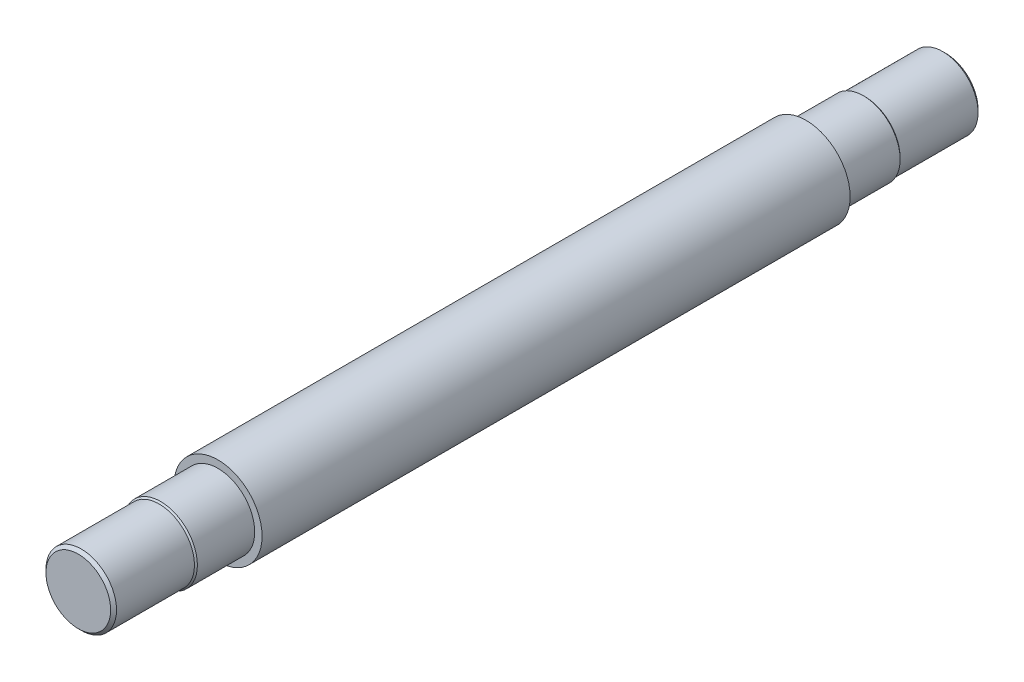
ISO-10303-21;
HEADER;
FILE_DESCRIPTION(('STEP AP214'),'2;1');
FILE_NAME('part.step','',(''),(''),'','','');
FILE_SCHEMA(('AUTOMOTIVE_DESIGN { 1 0 10303 214 1 1 1 1 }'));
ENDSEC;
DATA;
#1=APPLICATION_CONTEXT('core data for automotive mechanical design processes');
#2=APPLICATION_PROTOCOL_DEFINITION('international standard','automotive_design',2000,#1);
#3=PRODUCT_CONTEXT('',#1,'mechanical');
#4=PRODUCT('Part','Part','',(#3));
#5=PRODUCT_RELATED_PRODUCT_CATEGORY('part','',(#4));
#6=PRODUCT_DEFINITION_FORMATION('','',#4);
#7=PRODUCT_DEFINITION_CONTEXT('part definition',#1,'design');
#8=PRODUCT_DEFINITION('design','',#6,#7);
#9=PRODUCT_DEFINITION_SHAPE('','',#8);
#10=(LENGTH_UNIT() NAMED_UNIT(*) SI_UNIT(.MILLI.,.METRE.));
#11=(NAMED_UNIT(*) PLANE_ANGLE_UNIT() SI_UNIT($,.RADIAN.));
#12=(NAMED_UNIT(*) SI_UNIT($,.STERADIAN.) SOLID_ANGLE_UNIT());
#13=UNCERTAINTY_MEASURE_WITH_UNIT(LENGTH_MEASURE(1.E-05),#10,'distance_accuracy_value','');
#14=(GEOMETRIC_REPRESENTATION_CONTEXT(3) GLOBAL_UNCERTAINTY_ASSIGNED_CONTEXT((#13)) GLOBAL_UNIT_ASSIGNED_CONTEXT((#10,
#11,#12)) REPRESENTATION_CONTEXT('',''));
#15=CARTESIAN_POINT('',(0.,0.,0.));
#16=DIRECTION('',(0.,0.,1.));
#17=DIRECTION('',(1.,0.,0.));
#18=AXIS2_PLACEMENT_3D('',#15,#16,#17);
#19=CARTESIAN_POINT('',(0.,0.,400.));
#20=DIRECTION('',(0.,0.,-1.));
#21=DIRECTION('',(-1.,0.,0.));
#22=AXIS2_PLACEMENT_3D('',#19,#20,#21);
#23=CYLINDRICAL_SURFACE('',#22,30.);
#24=CARTESIAN_POINT('',(0.,0.,400.));
#25=DIRECTION('',(0.,0.,1.));
#26=DIRECTION('',(1.,0.,0.));
#27=AXIS2_PLACEMENT_3D('',#24,#25,#26);
#28=CIRCLE('',#27,30.);
#29=CARTESIAN_POINT('',(30.,0.,400.));
#30=VERTEX_POINT('',#29);
#31=EDGE_CURVE('E64',#30,#30,#28,.T.);
#32=ORIENTED_EDGE('',*,*,#31,.F.);
#33=EDGE_LOOP('',(#32));
#34=FACE_BOUND('',#33,.T.);
#35=CARTESIAN_POINT('',(0.,0.,0.));
#36=DIRECTION('',(0.,0.,1.));
#37=DIRECTION('',(1.,0.,0.));
#38=AXIS2_PLACEMENT_3D('',#35,#36,#37);
#39=CIRCLE('',#38,30.);
#40=CARTESIAN_POINT('',(30.,0.,0.));
#41=VERTEX_POINT('',#40);
#42=EDGE_CURVE('E65',#41,#41,#39,.T.);
#43=ORIENTED_EDGE('',*,*,#42,.T.);
#44=EDGE_LOOP('',(#43));
#45=FACE_BOUND('',#44,.T.);
#46=ADVANCED_FACE('F35',(#34,#45),#23,.T.);
#47=CARTESIAN_POINT('',(0.,0.,400.));
#48=DIRECTION('',(0.,0.,1.));
#49=DIRECTION('',(1.,0.,0.));
#50=AXIS2_PLACEMENT_3D('',#47,#48,#49);
#51=PLANE('',#50);
#52=CARTESIAN_POINT('',(0.,0.,400.));
#53=DIRECTION('',(0.,0.,1.));
#54=DIRECTION('',(1.,0.,0.));
#55=AXIS2_PLACEMENT_3D('',#52,#53,#54);
#56=CIRCLE('',#55,25.);
#57=CARTESIAN_POINT('',(25.,0.,400.));
#58=VERTEX_POINT('',#57);
#59=EDGE_CURVE('E68',#58,#58,#56,.T.);
#60=ORIENTED_EDGE('',*,*,#59,.F.);
#61=EDGE_LOOP('',(#60));
#62=FACE_BOUND('',#61,.T.);
#63=ORIENTED_EDGE('',*,*,#31,.T.);
#64=EDGE_LOOP('',(#63));
#65=FACE_BOUND('',#64,.T.);
#66=ADVANCED_FACE('F98',(#62,#65),#51,.T.);
#67=CARTESIAN_POINT('',(0.,0.,0.));
#68=DIRECTION('',(0.,0.,1.));
#69=DIRECTION('',(1.,0.,0.));
#70=AXIS2_PLACEMENT_3D('',#67,#68,#69);
#71=PLANE('',#70);
#72=CARTESIAN_POINT('',(0.,0.,0.));
#73=DIRECTION('',(0.,0.,1.));
#74=DIRECTION('',(1.,0.,0.));
#75=AXIS2_PLACEMENT_3D('',#72,#73,#74);
#76=CIRCLE('',#75,25.);
#77=CARTESIAN_POINT('',(25.,0.,0.));
#78=VERTEX_POINT('',#77);
#79=EDGE_CURVE('E61',#78,#78,#76,.F.);
#80=ORIENTED_EDGE('',*,*,#79,.F.);
#81=EDGE_LOOP('',(#80));
#82=FACE_BOUND('',#81,.T.);
#83=ORIENTED_EDGE('',*,*,#42,.F.);
#84=EDGE_LOOP('',(#83));
#85=FACE_BOUND('',#84,.T.);
#86=ADVANCED_FACE('F104',(#82,#85),#71,.F.);
#87=CARTESIAN_POINT('',(0.,0.,440.));
#88=DIRECTION('',(0.,0.,-1.));
#89=DIRECTION('',(-1.,0.,0.));
#90=AXIS2_PLACEMENT_3D('',#87,#88,#89);
#91=CYLINDRICAL_SURFACE('',#90,25.);
#92=CARTESIAN_POINT('',(0.,0.,439.));
#93=DIRECTION('',(0.,0.,1.));
#94=DIRECTION('',(1.,0.,0.));
#95=AXIS2_PLACEMENT_3D('',#92,#93,#94);
#96=CIRCLE('',#95,25.);
#97=CARTESIAN_POINT('',(25.,0.,439.));
#98=VERTEX_POINT('',#97);
#99=EDGE_CURVE('E55',#98,#98,#96,.F.);
#100=ORIENTED_EDGE('',*,*,#99,.T.);
#101=EDGE_LOOP('',(#100));
#102=FACE_BOUND('',#101,.T.);
#103=ORIENTED_EDGE('',*,*,#59,.T.);
#104=EDGE_LOOP('',(#103));
#105=FACE_BOUND('',#104,.T.);
#106=ADVANCED_FACE('F111',(#102,#105),#91,.T.);
#107=CARTESIAN_POINT('',(0.,0.,-40.));
#108=DIRECTION('',(0.,0.,1.));
#109=DIRECTION('',(1.,0.,0.));
#110=AXIS2_PLACEMENT_3D('',#107,#108,#109);
#111=CYLINDRICAL_SURFACE('',#110,25.);
#112=CARTESIAN_POINT('',(0.,0.,-38.9999999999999));
#113=DIRECTION('',(0.,0.,-1.));
#114=DIRECTION('',(-1.,0.,0.));
#115=AXIS2_PLACEMENT_3D('',#112,#113,#114);
#116=CIRCLE('',#115,25.);
#117=CARTESIAN_POINT('',(-25.,0.,-38.9999999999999));
#118=VERTEX_POINT('',#117);
#119=EDGE_CURVE('E58',#118,#118,#116,.F.);
#120=ORIENTED_EDGE('',*,*,#119,.T.);
#121=EDGE_LOOP('',(#120));
#122=FACE_BOUND('',#121,.T.);
#123=ORIENTED_EDGE('',*,*,#79,.T.);
#124=EDGE_LOOP('',(#123));
#125=FACE_BOUND('',#124,.T.);
#126=ADVANCED_FACE('F116',(#122,#125),#111,.T.);
#127=CARTESIAN_POINT('',(0.,0.,-95.));
#128=DIRECTION('',(0.,0.,1.));
#129=DIRECTION('',(1.,0.,0.));
#130=AXIS2_PLACEMENT_3D('',#127,#128,#129);
#131=CYLINDRICAL_SURFACE('',#130,24.);
#132=CARTESIAN_POINT('',(0.,0.,-93.0000000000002));
#133=DIRECTION('',(0.,0.,-1.));
#134=DIRECTION('',(-1.,0.,0.));
#135=AXIS2_PLACEMENT_3D('',#132,#133,#134);
#136=CIRCLE('',#135,24.);
#137=CARTESIAN_POINT('',(-24.,0.,-93.0000000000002));
#138=VERTEX_POINT('',#137);
#139=EDGE_CURVE('E10',#138,#138,#136,.F.);
#140=ORIENTED_EDGE('',*,*,#139,.T.);
#141=EDGE_LOOP('',(#140));
#142=FACE_BOUND('',#141,.T.);
#143=CARTESIAN_POINT('',(0.,0.,-40.));
#144=DIRECTION('',(0.,0.,-1.));
#145=DIRECTION('',(-1.,0.,0.));
#146=AXIS2_PLACEMENT_3D('',#143,#144,#145);
#147=CIRCLE('',#146,24.);
#148=CARTESIAN_POINT('',(-24.,0.,-40.));
#149=VERTEX_POINT('',#148);
#150=EDGE_CURVE('E73',#149,#149,#147,.T.);
#151=ORIENTED_EDGE('',*,*,#150,.T.);
#152=EDGE_LOOP('',(#151));
#153=FACE_BOUND('',#152,.T.);
#154=ADVANCED_FACE('F120',(#142,#153),#131,.T.);
#155=CARTESIAN_POINT('',(0.,0.,-95.));
#156=DIRECTION('',(0.,0.,-1.));
#157=DIRECTION('',(-1.,0.,0.));
#158=AXIS2_PLACEMENT_3D('',#155,#156,#157);
#159=PLANE('',#158);
#160=CARTESIAN_POINT('',(0.,0.,-95.));
#161=DIRECTION('',(0.,0.,-1.));
#162=DIRECTION('',(-1.,0.,0.));
#163=AXIS2_PLACEMENT_3D('',#160,#161,#162);
#164=CIRCLE('',#163,22.0000000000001);
#165=CARTESIAN_POINT('',(-22.0000000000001,0.,-95.));
#166=VERTEX_POINT('',#165);
#167=EDGE_CURVE('E42',#166,#166,#164,.T.);
#168=ORIENTED_EDGE('',*,*,#167,.T.);
#169=EDGE_LOOP('',(#168));
#170=FACE_BOUND('',#169,.T.);
#171=ADVANCED_FACE('F124',(#170),#159,.T.);
#172=CARTESIAN_POINT('',(0.,0.,495.));
#173=DIRECTION('',(0.,0.,-1.));
#174=DIRECTION('',(-1.,0.,0.));
#175=AXIS2_PLACEMENT_3D('',#172,#173,#174);
#176=CYLINDRICAL_SURFACE('',#175,24.);
#177=CARTESIAN_POINT('',(0.,0.,493.));
#178=DIRECTION('',(0.,0.,1.));
#179=DIRECTION('',(1.,0.,0.));
#180=AXIS2_PLACEMENT_3D('',#177,#178,#179);
#181=CIRCLE('',#180,24.);
#182=CARTESIAN_POINT('',(24.,0.,493.));
#183=VERTEX_POINT('',#182);
#184=EDGE_CURVE('E46',#183,#183,#181,.F.);
#185=ORIENTED_EDGE('',*,*,#184,.T.);
#186=EDGE_LOOP('',(#185));
#187=FACE_BOUND('',#186,.T.);
#188=CARTESIAN_POINT('',(0.,0.,440.));
#189=DIRECTION('',(0.,0.,1.));
#190=DIRECTION('',(1.,0.,0.));
#191=AXIS2_PLACEMENT_3D('',#188,#189,#190);
#192=CIRCLE('',#191,24.);
#193=CARTESIAN_POINT('',(24.,0.,440.));
#194=VERTEX_POINT('',#193);
#195=EDGE_CURVE('E76',#194,#194,#192,.T.);
#196=ORIENTED_EDGE('',*,*,#195,.T.);
#197=EDGE_LOOP('',(#196));
#198=FACE_BOUND('',#197,.T.);
#199=ADVANCED_FACE('F80',(#187,#198),#176,.T.);
#200=CARTESIAN_POINT('',(0.,0.,495.));
#201=DIRECTION('',(0.,0.,1.));
#202=DIRECTION('',(1.,0.,0.));
#203=AXIS2_PLACEMENT_3D('',#200,#201,#202);
#204=PLANE('',#203);
#205=CARTESIAN_POINT('',(0.,0.,495.));
#206=DIRECTION('',(0.,0.,1.));
#207=DIRECTION('',(1.,0.,0.));
#208=AXIS2_PLACEMENT_3D('',#205,#206,#207);
#209=CIRCLE('',#208,22.);
#210=CARTESIAN_POINT('',(22.,0.,495.));
#211=VERTEX_POINT('',#210);
#212=EDGE_CURVE('E50',#211,#211,#209,.T.);
#213=ORIENTED_EDGE('',*,*,#212,.T.);
#214=EDGE_LOOP('',(#213));
#215=FACE_BOUND('',#214,.T.);
#216=ADVANCED_FACE('F93',(#215),#204,.T.);
#217=CARTESIAN_POINT('',(0.,0.,-40.));
#218=DIRECTION('',(0.,0.,1.));
#219=DIRECTION('',(1.,0.,0.));
#220=AXIS2_PLACEMENT_3D('',#217,#218,#219);
#221=CONICAL_SURFACE('',#220,23.9999999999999,0.785398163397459);
#222=ORIENTED_EDGE('',*,*,#119,.F.);
#223=EDGE_LOOP('',(#222));
#224=FACE_BOUND('',#223,.T.);
#225=ORIENTED_EDGE('',*,*,#150,.F.);
#226=EDGE_LOOP('',(#225));
#227=FACE_BOUND('',#226,.T.);
#228=ADVANCED_FACE('F85',(#224,#227),#221,.T.);
#229=CARTESIAN_POINT('',(0.,0.,440.));
#230=DIRECTION('',(0.,0.,-1.));
#231=DIRECTION('',(-1.,0.,0.));
#232=AXIS2_PLACEMENT_3D('',#229,#230,#231);
#233=CONICAL_SURFACE('',#232,23.9999999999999,0.785398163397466);
#234=ORIENTED_EDGE('',*,*,#99,.F.);
#235=EDGE_LOOP('',(#234));
#236=FACE_BOUND('',#235,.T.);
#237=ORIENTED_EDGE('',*,*,#195,.F.);
#238=EDGE_LOOP('',(#237));
#239=FACE_BOUND('',#238,.T.);
#240=ADVANCED_FACE('F82',(#236,#239),#233,.T.);
#241=CARTESIAN_POINT('',(0.,0.,495.));
#242=DIRECTION('',(0.,0.,-1.));
#243=DIRECTION('',(-1.,0.,0.));
#244=AXIS2_PLACEMENT_3D('',#241,#242,#243);
#245=CONICAL_SURFACE('',#244,22.,0.785398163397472);
#246=ORIENTED_EDGE('',*,*,#184,.F.);
#247=EDGE_LOOP('',(#246));
#248=FACE_BOUND('',#247,.T.);
#249=ORIENTED_EDGE('',*,*,#212,.F.);
#250=EDGE_LOOP('',(#249));
#251=FACE_BOUND('',#250,.T.);
#252=ADVANCED_FACE('F84',(#248,#251),#245,.T.);
#253=CARTESIAN_POINT('',(0.,0.,-95.));
#254=DIRECTION('',(0.,0.,1.));
#255=DIRECTION('',(1.,0.,0.));
#256=AXIS2_PLACEMENT_3D('',#253,#254,#255);
#257=CONICAL_SURFACE('',#256,22.0000000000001,0.785398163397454);
#258=ORIENTED_EDGE('',*,*,#139,.F.);
#259=EDGE_LOOP('',(#258));
#260=FACE_BOUND('',#259,.T.);
#261=ORIENTED_EDGE('',*,*,#167,.F.);
#262=EDGE_LOOP('',(#261));
#263=FACE_BOUND('',#262,.T.);
#264=ADVANCED_FACE('F37',(#260,#263),#257,.T.);
#265=CLOSED_SHELL('',(#46,#66,#86,#106,#126,#154,#171,#199,#216,#228,#240,#252,#264));
#266=MANIFOLD_SOLID_BREP('B2',#265);
#267=ADVANCED_BREP_SHAPE_REPRESENTATION('',(#18,#266),#14);
#268=SHAPE_DEFINITION_REPRESENTATION(#9,#267);
ENDSEC;
END-ISO-10303-21;
